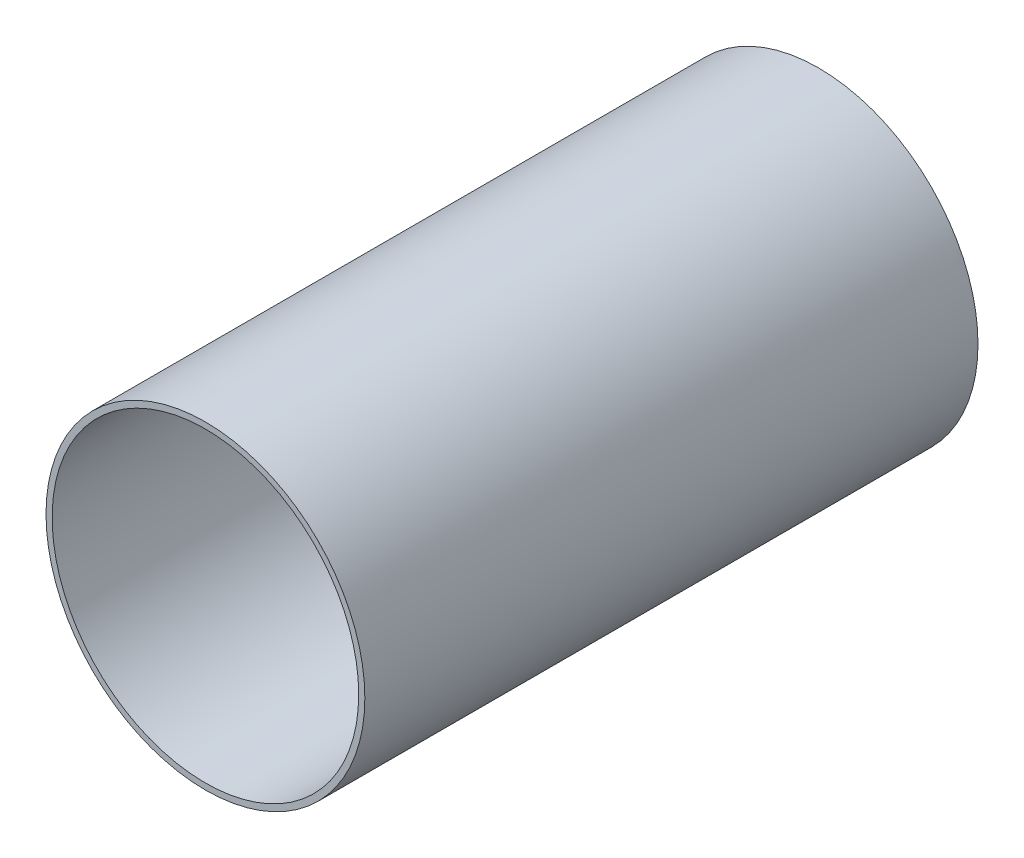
ISO-10303-21;
HEADER;
FILE_DESCRIPTION(('STEP AP214'),'2;1');
FILE_NAME('part.step','',(''),(''),'','','');
FILE_SCHEMA(('AUTOMOTIVE_DESIGN { 1 0 10303 214 1 1 1 1 }'));
ENDSEC;
DATA;
#1=APPLICATION_CONTEXT('core data for automotive mechanical design processes');
#2=APPLICATION_PROTOCOL_DEFINITION('international standard','automotive_design',2000,#1);
#3=PRODUCT_CONTEXT('',#1,'mechanical');
#4=PRODUCT('Part','Part','',(#3));
#5=PRODUCT_RELATED_PRODUCT_CATEGORY('part','',(#4));
#6=PRODUCT_DEFINITION_FORMATION('','',#4);
#7=PRODUCT_DEFINITION_CONTEXT('part definition',#1,'design');
#8=PRODUCT_DEFINITION('design','',#6,#7);
#9=PRODUCT_DEFINITION_SHAPE('','',#8);
#10=(LENGTH_UNIT() NAMED_UNIT(*) SI_UNIT(.MILLI.,.METRE.));
#11=(NAMED_UNIT(*) PLANE_ANGLE_UNIT() SI_UNIT($,.RADIAN.));
#12=(NAMED_UNIT(*) SI_UNIT($,.STERADIAN.) SOLID_ANGLE_UNIT());
#13=UNCERTAINTY_MEASURE_WITH_UNIT(LENGTH_MEASURE(1.E-05),#10,'distance_accuracy_value','');
#14=(GEOMETRIC_REPRESENTATION_CONTEXT(3) GLOBAL_UNCERTAINTY_ASSIGNED_CONTEXT((#13)) GLOBAL_UNIT_ASSIGNED_CONTEXT((#10,
#11,#12)) REPRESENTATION_CONTEXT('',''));
#15=CARTESIAN_POINT('',(0.,0.,0.));
#16=DIRECTION('',(0.,0.,1.));
#17=DIRECTION('',(1.,0.,0.));
#18=AXIS2_PLACEMENT_3D('',#15,#16,#17);
#19=CARTESIAN_POINT('',(0.,0.,100.));
#20=DIRECTION('',(0.,0.,1.));
#21=DIRECTION('',(1.,0.,0.));
#22=AXIS2_PLACEMENT_3D('',#19,#20,#21);
#23=PLANE('',#22);
#24=CARTESIAN_POINT('',(0.,0.,100.));
#25=DIRECTION('',(0.,0.,1.));
#26=DIRECTION('',(1.,0.,0.));
#27=AXIS2_PLACEMENT_3D('',#24,#25,#26);
#28=CIRCLE('',#27,52.);
#29=CARTESIAN_POINT('',(52.,0.,100.));
#30=VERTEX_POINT('',#29);
#31=EDGE_CURVE('E154',#30,#30,#28,.T.);
#32=ORIENTED_EDGE('',*,*,#31,.T.);
#33=EDGE_LOOP('',(#32));
#34=FACE_BOUND('',#33,.T.);
#35=CARTESIAN_POINT('',(0.,0.,100.));
#36=DIRECTION('',(0.,0.,1.));
#37=DIRECTION('',(1.,0.,0.));
#38=AXIS2_PLACEMENT_3D('',#35,#36,#37);
#39=CIRCLE('',#38,50.);
#40=CARTESIAN_POINT('',(50.,0.,100.));
#41=VERTEX_POINT('',#40);
#42=EDGE_CURVE('E108',#41,#41,#39,.T.);
#43=ORIENTED_EDGE('',*,*,#42,.F.);
#44=EDGE_LOOP('',(#43));
#45=FACE_BOUND('',#44,.T.);
#46=ADVANCED_FACE('F43',(#34,#45),#23,.T.);
#47=CARTESIAN_POINT('',(0.,0.,-100.));
#48=DIRECTION('',(0.,0.,1.));
#49=DIRECTION('',(1.,0.,0.));
#50=AXIS2_PLACEMENT_3D('',#47,#48,#49);
#51=PLANE('',#50);
#52=CARTESIAN_POINT('',(0.,0.,-100.));
#53=DIRECTION('',(0.,0.,1.));
#54=DIRECTION('',(1.,0.,0.));
#55=AXIS2_PLACEMENT_3D('',#52,#53,#54);
#56=CIRCLE('',#55,52.);
#57=CARTESIAN_POINT('',(52.,0.,-100.));
#58=VERTEX_POINT('',#57);
#59=EDGE_CURVE('E156',#58,#58,#56,.T.);
#60=ORIENTED_EDGE('',*,*,#59,.F.);
#61=EDGE_LOOP('',(#60));
#62=FACE_BOUND('',#61,.T.);
#63=CARTESIAN_POINT('',(0.,0.,-100.));
#64=DIRECTION('',(0.,0.,1.));
#65=DIRECTION('',(1.,0.,0.));
#66=AXIS2_PLACEMENT_3D('',#63,#64,#65);
#67=CIRCLE('',#66,50.);
#68=CARTESIAN_POINT('',(50.,0.,-100.));
#69=VERTEX_POINT('',#68);
#70=EDGE_CURVE('E105',#69,#69,#67,.T.);
#71=ORIENTED_EDGE('',*,*,#70,.T.);
#72=EDGE_LOOP('',(#71));
#73=FACE_BOUND('',#72,.T.);
#74=ADVANCED_FACE('F168',(#62,#73),#51,.F.);
#75=CARTESIAN_POINT('',(0.,0.,100.));
#76=DIRECTION('',(0.,0.,-1.));
#77=DIRECTION('',(-1.,0.,0.));
#78=AXIS2_PLACEMENT_3D('',#75,#76,#77);
#79=CYLINDRICAL_SURFACE('',#78,52.);
#80=CARTESIAN_POINT('',(-39.6356821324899,33.6602540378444,38.3012701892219));
#81=CARTESIAN_POINT('',(-39.5441065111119,33.7680893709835,38.4880316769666));
#82=CARTESIAN_POINT('',(-39.4562105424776,33.8706933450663,38.6797156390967));
#83=CARTESIAN_POINT('',(-39.2889634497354,34.0645520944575,39.0725721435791));
#84=CARTESIAN_POINT('',(-39.2096204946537,34.1557960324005,39.2737534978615));
#85=CARTESIAN_POINT('',(-39.0604007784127,34.3263459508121,39.6861152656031));
#86=CARTESIAN_POINT('',(-38.9905831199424,34.4055777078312,39.897348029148));
#87=CARTESIAN_POINT('',(-38.8623289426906,34.5503798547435,40.3277576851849));
#88=CARTESIAN_POINT('',(-38.8038892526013,34.6159540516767,40.5469323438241));
#89=CARTESIAN_POINT('',(-38.6993295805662,34.7328099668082,40.9934609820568));
#90=CARTESIAN_POINT('',(-38.6532867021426,34.7840023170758,41.2208566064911));
#91=CARTESIAN_POINT('',(-38.5751425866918,34.8706436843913,41.6810229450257));
#92=CARTESIAN_POINT('',(-38.5430422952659,34.9060916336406,41.9137940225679));
#93=CARTESIAN_POINT('',(-38.4937502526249,34.9604425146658,42.3820557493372));
#94=CARTESIAN_POINT('',(-38.4765101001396,34.9793991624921,42.6175350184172));
#95=CARTESIAN_POINT('',(-38.4572636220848,35.000558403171,43.0898541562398));
#96=CARTESIAN_POINT('',(-38.4552556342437,35.0027628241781,43.3266938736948));
#97=CARTESIAN_POINT('',(-38.4659928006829,34.9909622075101,43.7772945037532));
#98=CARTESIAN_POINT('',(-38.4773678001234,34.9784625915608,43.9911304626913));
#99=CARTESIAN_POINT('',(-38.5123814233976,34.9399077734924,44.416547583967));
#100=CARTESIAN_POINT('',(-38.5360192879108,34.9138534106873,44.628128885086));
#101=CARTESIAN_POINT('',(-38.5950449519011,34.8485930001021,45.0477991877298));
#102=CARTESIAN_POINT('',(-38.6304446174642,34.8093736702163,45.255884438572));
#103=CARTESIAN_POINT('',(-38.7122270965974,34.7183987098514,45.6670848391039));
#104=CARTESIAN_POINT('',(-38.7586103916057,34.6666425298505,45.870199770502));
#105=CARTESIAN_POINT('',(-38.861793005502,34.5509345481,46.2717208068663));
#106=CARTESIAN_POINT('',(-38.918657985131,34.4869057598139,46.470087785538));
#107=CARTESIAN_POINT('',(-39.0416011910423,34.3476639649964,46.8599323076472));
#108=CARTESIAN_POINT('',(-39.1076822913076,34.2724474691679,47.0514076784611));
#109=CARTESIAN_POINT('',(-39.3182362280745,34.0311874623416,47.6145331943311));
#110=CARTESIAN_POINT('',(-39.475066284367,33.8494817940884,47.9750584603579));
#111=CARTESIAN_POINT('',(-39.7701553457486,33.5018306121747,48.5744504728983));
#112=CARTESIAN_POINT('',(-39.9028726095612,33.3437811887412,48.8208161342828));
#113=CARTESIAN_POINT('',(-40.1793547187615,33.0100948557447,49.294792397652));
#114=CARTESIAN_POINT('',(-40.3231206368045,32.8344562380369,49.5224011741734));
#115=CARTESIAN_POINT('',(-40.6194448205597,32.4671601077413,49.9588246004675));
#116=CARTESIAN_POINT('',(-40.7720166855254,32.2754776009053,50.1676088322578));
#117=CARTESIAN_POINT('',(-41.0836221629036,31.8778885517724,50.5658277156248));
#118=CARTESIAN_POINT('',(-41.2426551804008,31.6719833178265,50.7552641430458));
#119=CARTESIAN_POINT('',(-41.5679515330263,31.2438607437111,51.1175411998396));
#120=CARTESIAN_POINT('',(-41.7342898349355,31.0214351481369,51.2900678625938));
#121=CARTESIAN_POINT('',(-42.0701019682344,30.5644716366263,51.6148270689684));
#122=CARTESIAN_POINT('',(-42.239575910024,30.3299332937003,51.7670588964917));
#123=CARTESIAN_POINT('',(-42.5801425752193,29.8499251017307,52.0508955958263));
#124=CARTESIAN_POINT('',(-42.7512348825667,29.6044580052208,52.1825056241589));
#125=CARTESIAN_POINT('',(-43.0937663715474,29.1035973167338,52.4247500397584));
#126=CARTESIAN_POINT('',(-43.2652055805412,28.8482029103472,52.5353827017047));
#127=CARTESIAN_POINT('',(-43.6361078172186,28.2846638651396,52.7520290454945));
#128=CARTESIAN_POINT('',(-43.8354148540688,27.9748937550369,52.854108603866));
#129=CARTESIAN_POINT('',(-44.2310559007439,27.3450549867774,53.0279064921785));
#130=CARTESIAN_POINT('',(-44.4273895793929,27.024985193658,53.0996214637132));
#131=CARTESIAN_POINT('',(-44.8154835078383,26.3764155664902,53.2115584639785));
#132=CARTESIAN_POINT('',(-45.0072414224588,26.0479115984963,53.2517647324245));
#133=CARTESIAN_POINT('',(-45.3844616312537,25.3849574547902,53.2993817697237));
#134=CARTESIAN_POINT('',(-45.5699243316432,25.0505076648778,53.3067946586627));
#135=CARTESIAN_POINT('',(-45.9292067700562,24.38540107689,53.2877904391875));
#136=CARTESIAN_POINT('',(-46.1031894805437,24.0548128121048,53.2620827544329));
#137=CARTESIAN_POINT('',(-46.4423008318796,23.3933928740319,53.1769982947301));
#138=CARTESIAN_POINT('',(-46.6074292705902,23.0625611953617,53.1176207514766));
#139=CARTESIAN_POINT('',(-46.9274703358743,22.4041580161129,52.9643797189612));
#140=CARTESIAN_POINT('',(-47.0823907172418,22.0765842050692,52.8705427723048));
#141=CARTESIAN_POINT('',(-47.3062674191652,21.5904838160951,52.703641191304));
#142=CARTESIAN_POINT('',(-47.3794748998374,21.4293288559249,52.6436504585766));
#143=CARTESIAN_POINT('',(-47.5229844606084,21.1091620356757,52.5149100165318));
#144=CARTESIAN_POINT('',(-47.5932855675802,20.9501509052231,52.4461574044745));
#145=CARTESIAN_POINT('',(-47.7832146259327,20.5147772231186,52.2442243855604));
#146=CARTESIAN_POINT('',(-47.8996558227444,20.2412220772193,52.101838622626));
#147=CARTESIAN_POINT('',(-48.1225068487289,19.7055459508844,51.7903670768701));
#148=CARTESIAN_POINT('',(-48.2289180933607,19.4434233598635,51.6212850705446));
#149=CARTESIAN_POINT('',(-48.4312298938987,18.933858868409,51.2573860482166));
#150=CARTESIAN_POINT('',(-48.5271434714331,18.6863989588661,51.0626015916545));
#151=CARTESIAN_POINT('',(-48.708311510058,18.2089434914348,50.6484777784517));
#152=CARTESIAN_POINT('',(-48.7935697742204,17.9789417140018,50.4291472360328));
#153=CARTESIAN_POINT('',(-48.971771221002,17.4885218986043,49.9142325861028));
#154=CARTESIAN_POINT('',(-49.0619764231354,17.233264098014,49.6127091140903));
#155=CARTESIAN_POINT('',(-49.1850795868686,16.8773152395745,49.1374747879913));
#156=CARTESIAN_POINT('',(-49.2240828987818,16.7631459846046,48.9752224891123));
#157=CARTESIAN_POINT('',(-49.2980880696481,16.5442379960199,48.6435137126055));
#158=CARTESIAN_POINT('',(-49.3330884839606,16.4395026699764,48.4740546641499));
#159=CARTESIAN_POINT('',(-49.3661088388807,16.3397459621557,48.3012701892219));
#160=B_SPLINE_CURVE_WITH_KNOTS('',3,(#80,#81,#82,#83,#84,#85,#86,#87,#88,#89,#90,#91,#92,#93,
#94,#95,#96,#97,#98,#99,#100,#101,#102,#103,#104,#105,#106,#107,#108,#109,#110,#111,#112,#113,
#114,#115,#116,#117,#118,#119,#120,#121,#122,#123,#124,#125,#126,#127,#128,#129,#130,#131,#132,
#133,#134,#135,#136,#137,#138,#139,#140,#141,#142,#143,#144,#145,#146,#147,#148,#149,#150,#151,
#152,#153,#154,#155,#156,#157,#158,#159),.UNSPECIFIED.,.F.,.F.,(4,2,2,2,2,2,2,2,2,2,2,2,2,2,2,2,
2,2,2,2,2,2,2,2,2,2,2,2,2,2,2,2,2,2,2,2,2,2,2,4),(0.,0.702864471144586,1.40639441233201,
2.11410832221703,2.82162469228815,3.53344490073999,4.24531337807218,4.95485435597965,
5.66431790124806,6.3070374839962,6.94971727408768,7.59304742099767,8.23640577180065,
8.88394046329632,9.53167753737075,10.8265899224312,11.7896291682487,12.7527620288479,
13.7174242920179,14.6819979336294,15.6620021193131,16.6420408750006,17.6218341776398,
18.6017080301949,19.7470344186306,20.8924874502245,22.0385130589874,23.184464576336,
24.3062737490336,25.4281085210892,26.5490809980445,27.1095546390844,27.6702144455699,
28.6576494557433,29.6449449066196,30.6310014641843,31.6167050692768,32.8289750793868,
33.4352217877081,34.0416866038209),.UNSPECIFIED.);
#161=CARTESIAN_POINT('',(-39.6356821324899,33.6602540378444,38.3012701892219));
#162=VERTEX_POINT('',#161);
#163=CARTESIAN_POINT('',(-49.3661088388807,16.3397459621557,48.3012701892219));
#164=VERTEX_POINT('',#163);
#165=EDGE_CURVE('E98',#162,#164,#160,.T.);
#166=ORIENTED_EDGE('',*,*,#165,.T.);
#167=CARTESIAN_POINT('',(0.,0.,19.9999999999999));
#168=DIRECTION('',(0.,-0.866025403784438,0.500000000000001));
#169=DIRECTION('',(0.,-0.500000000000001,-0.866025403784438));
#170=AXIS2_PLACEMENT_3D('',#167,#168,#169);
#171=ELLIPSE('',#170,104.,52.);
#172=CARTESIAN_POINT('',(-39.6356821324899,-33.6602540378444,-38.3012701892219));
#173=VERTEX_POINT('',#172);
#174=EDGE_CURVE('E64',#164,#173,#171,.T.);
#175=ORIENTED_EDGE('',*,*,#174,.T.);
#176=CARTESIAN_POINT('',(-39.6356821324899,-33.6602540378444,-38.3012701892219));
#177=CARTESIAN_POINT('',(-39.5441065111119,-33.7680893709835,-38.4880316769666));
#178=CARTESIAN_POINT('',(-39.4562105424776,-33.8706933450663,-38.6797156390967));
#179=CARTESIAN_POINT('',(-39.2889634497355,-34.0645520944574,-39.0725721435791));
#180=CARTESIAN_POINT('',(-39.2096204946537,-34.1557960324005,-39.2737534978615));
#181=CARTESIAN_POINT('',(-39.0604007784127,-34.3263459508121,-39.6861152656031));
#182=CARTESIAN_POINT('',(-38.9905831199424,-34.4055777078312,-39.897348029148));
#183=CARTESIAN_POINT('',(-38.8623289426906,-34.5503798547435,-40.3277576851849));
#184=CARTESIAN_POINT('',(-38.8038892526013,-34.6159540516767,-40.5469323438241));
#185=CARTESIAN_POINT('',(-38.6993295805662,-34.7328099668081,-40.9934609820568));
#186=CARTESIAN_POINT('',(-38.6532867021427,-34.7840023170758,-41.2208566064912));
#187=CARTESIAN_POINT('',(-38.5751425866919,-34.8706436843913,-41.6810229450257));
#188=CARTESIAN_POINT('',(-38.5430422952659,-34.9060916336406,-41.9137940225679));
#189=CARTESIAN_POINT('',(-38.4937502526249,-34.9604425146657,-42.3820557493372));
#190=CARTESIAN_POINT('',(-38.4765101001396,-34.9793991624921,-42.6175350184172));
#191=CARTESIAN_POINT('',(-38.4572636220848,-35.000558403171,-43.0898541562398));
#192=CARTESIAN_POINT('',(-38.4552556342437,-35.0027628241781,-43.3266938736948));
#193=CARTESIAN_POINT('',(-38.465992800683,-34.9909622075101,-43.7772945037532));
#194=CARTESIAN_POINT('',(-38.4773678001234,-34.9784625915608,-43.9911304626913));
#195=CARTESIAN_POINT('',(-38.5123814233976,-34.9399077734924,-44.416547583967));
#196=CARTESIAN_POINT('',(-38.5360192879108,-34.9138534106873,-44.628128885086));
#197=CARTESIAN_POINT('',(-38.5950449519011,-34.8485930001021,-45.0477991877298));
#198=CARTESIAN_POINT('',(-38.6304446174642,-34.8093736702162,-45.255884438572));
#199=CARTESIAN_POINT('',(-38.7122270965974,-34.7183987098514,-45.6670848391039));
#200=CARTESIAN_POINT('',(-38.7586103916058,-34.6666425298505,-45.8701997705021));
#201=CARTESIAN_POINT('',(-38.861793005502,-34.5509345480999,-46.2717208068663));
#202=CARTESIAN_POINT('',(-38.918657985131,-34.4869057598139,-46.4700877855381));
#203=CARTESIAN_POINT('',(-39.0416011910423,-34.3476639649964,-46.8599323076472));
#204=CARTESIAN_POINT('',(-39.1076822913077,-34.2724474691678,-47.0514076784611));
#205=CARTESIAN_POINT('',(-39.3182362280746,-34.0311874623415,-47.6145331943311));
#206=CARTESIAN_POINT('',(-39.475066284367,-33.8494817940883,-47.9750584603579));
#207=CARTESIAN_POINT('',(-39.7701553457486,-33.5018306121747,-48.5744504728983));
#208=CARTESIAN_POINT('',(-39.9028726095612,-33.3437811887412,-48.8208161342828));
#209=CARTESIAN_POINT('',(-40.1793547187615,-33.0100948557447,-49.294792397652));
#210=CARTESIAN_POINT('',(-40.3231206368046,-32.8344562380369,-49.5224011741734));
#211=CARTESIAN_POINT('',(-40.6194448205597,-32.4671601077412,-49.9588246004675));
#212=CARTESIAN_POINT('',(-40.7720166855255,-32.2754776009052,-50.1676088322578));
#213=CARTESIAN_POINT('',(-41.0836221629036,-31.8778885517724,-50.5658277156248));
#214=CARTESIAN_POINT('',(-41.2426551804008,-31.6719833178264,-50.7552641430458));
#215=CARTESIAN_POINT('',(-41.5679515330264,-31.2438607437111,-51.1175411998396));
#216=CARTESIAN_POINT('',(-41.7342898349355,-31.0214351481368,-51.2900678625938));
#217=CARTESIAN_POINT('',(-42.0701019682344,-30.5644716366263,-51.6148270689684));
#218=CARTESIAN_POINT('',(-42.2395759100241,-30.3299332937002,-51.7670588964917));
#219=CARTESIAN_POINT('',(-42.5801425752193,-29.8499251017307,-52.0508955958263));
#220=CARTESIAN_POINT('',(-42.7512348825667,-29.6044580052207,-52.1825056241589));
#221=CARTESIAN_POINT('',(-43.0937663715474,-29.1035973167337,-52.4247500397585));
#222=CARTESIAN_POINT('',(-43.2652055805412,-28.8482029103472,-52.5353827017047));
#223=CARTESIAN_POINT('',(-43.6361078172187,-28.2846638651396,-52.7520290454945));
#224=CARTESIAN_POINT('',(-43.8354148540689,-27.9748937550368,-52.854108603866));
#225=CARTESIAN_POINT('',(-44.231055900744,-27.3450549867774,-53.0279064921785));
#226=CARTESIAN_POINT('',(-44.427389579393,-27.0249851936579,-53.0996214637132));
#227=CARTESIAN_POINT('',(-44.8154835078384,-26.3764155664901,-53.2115584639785));
#228=CARTESIAN_POINT('',(-45.0072414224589,-26.0479115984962,-53.2517647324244));
#229=CARTESIAN_POINT('',(-45.3844616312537,-25.3849574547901,-53.2993817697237));
#230=CARTESIAN_POINT('',(-45.5699243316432,-25.0505076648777,-53.3067946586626));
#231=CARTESIAN_POINT('',(-45.9292067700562,-24.38540107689,-53.2877904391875));
#232=CARTESIAN_POINT('',(-46.1031894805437,-24.0548128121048,-53.2620827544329));
#233=CARTESIAN_POINT('',(-46.4423008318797,-23.3933928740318,-53.1769982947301));
#234=CARTESIAN_POINT('',(-46.6074292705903,-23.0625611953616,-53.1176207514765));
#235=CARTESIAN_POINT('',(-46.9274703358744,-22.4041580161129,-52.9643797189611));
#236=CARTESIAN_POINT('',(-47.0823907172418,-22.0765842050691,-52.8705427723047));
#237=CARTESIAN_POINT('',(-47.3062674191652,-21.5904838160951,-52.7036411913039));
#238=CARTESIAN_POINT('',(-47.3794748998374,-21.4293288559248,-52.6436504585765));
#239=CARTESIAN_POINT('',(-47.5229844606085,-21.1091620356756,-52.5149100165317));
#240=CARTESIAN_POINT('',(-47.5932855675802,-20.9501509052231,-52.4461574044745));
#241=CARTESIAN_POINT('',(-47.7832146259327,-20.5147772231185,-52.2442243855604));
#242=CARTESIAN_POINT('',(-47.8996558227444,-20.2412220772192,-52.101838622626));
#243=CARTESIAN_POINT('',(-48.1225068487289,-19.7055459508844,-51.79036707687));
#244=CARTESIAN_POINT('',(-48.2289180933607,-19.4434233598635,-51.6212850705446));
#245=CARTESIAN_POINT('',(-48.4312298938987,-18.933858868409,-51.2573860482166));
#246=CARTESIAN_POINT('',(-48.5271434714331,-18.6863989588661,-51.0626015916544));
#247=CARTESIAN_POINT('',(-48.708311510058,-18.2089434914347,-50.6484777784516));
#248=CARTESIAN_POINT('',(-48.7935697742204,-17.9789417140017,-50.4291472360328));
#249=CARTESIAN_POINT('',(-48.971771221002,-17.4885218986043,-49.9142325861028));
#250=CARTESIAN_POINT('',(-49.0619764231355,-17.2332640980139,-49.6127091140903));
#251=CARTESIAN_POINT('',(-49.1850795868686,-16.8773152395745,-49.1374747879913));
#252=CARTESIAN_POINT('',(-49.2240828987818,-16.7631459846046,-48.9752224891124));
#253=CARTESIAN_POINT('',(-49.2980880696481,-16.5442379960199,-48.6435137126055));
#254=CARTESIAN_POINT('',(-49.3330884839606,-16.4395026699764,-48.4740546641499));
#255=CARTESIAN_POINT('',(-49.3661088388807,-16.3397459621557,-48.301270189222));
#256=B_SPLINE_CURVE_WITH_KNOTS('',3,(#176,#177,#178,#179,#180,#181,#182,#183,#184,#185,#186,
#187,#188,#189,#190,#191,#192,#193,#194,#195,#196,#197,#198,#199,#200,#201,#202,#203,#204,#205,
#206,#207,#208,#209,#210,#211,#212,#213,#214,#215,#216,#217,#218,#219,#220,#221,#222,#223,#224,
#225,#226,#227,#228,#229,#230,#231,#232,#233,#234,#235,#236,#237,#238,#239,#240,#241,#242,#243,
#244,#245,#246,#247,#248,#249,#250,#251,#252,#253,#254,#255),.UNSPECIFIED.,.F.,.F.,(4,2,2,2,2,2,
2,2,2,2,2,2,2,2,2,2,2,2,2,2,2,2,2,2,2,2,2,2,2,2,2,2,2,2,2,2,2,2,2,4),(0.,0.702864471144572,
1.40639441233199,2.11410832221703,2.82162469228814,3.53344490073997,4.24531337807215,
4.95485435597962,5.66431790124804,6.30703748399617,6.94971727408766,7.59304742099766,
8.23640577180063,8.88394046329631,9.53167753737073,10.8265899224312,11.7896291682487,
12.7527620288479,13.7174242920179,14.6819979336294,15.6620021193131,16.6420408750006,
17.6218341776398,18.6017080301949,19.7470344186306,20.8924874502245,22.0385130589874,
23.1844645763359,24.3062737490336,25.4281085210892,26.5490809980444,27.1095546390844,
27.6702144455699,28.6576494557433,29.6449449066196,30.6310014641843,31.6167050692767,
32.8289750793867,33.4352217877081,34.0416866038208),.UNSPECIFIED.);
#257=CARTESIAN_POINT('',(-49.3661088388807,-16.3397459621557,-48.301270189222));
#258=VERTEX_POINT('',#257);
#259=EDGE_CURVE('E91',#173,#258,#256,.T.);
#260=ORIENTED_EDGE('',*,*,#259,.T.);
#261=CARTESIAN_POINT('',(0.,0.,-20.));
#262=DIRECTION('',(0.,0.866025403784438,-0.500000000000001));
#263=DIRECTION('',(0.,-0.500000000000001,-0.866025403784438));
#264=AXIS2_PLACEMENT_3D('',#261,#262,#263);
#265=ELLIPSE('',#264,104.,52.);
#266=EDGE_CURVE('E104',#258,#162,#265,.T.);
#267=ORIENTED_EDGE('',*,*,#266,.T.);
#268=EDGE_LOOP('',(#166,#175,#260,#267));
#269=FACE_BOUND('',#268,.T.);
#270=ORIENTED_EDGE('',*,*,#31,.F.);
#271=EDGE_LOOP('',(#270));
#272=FACE_BOUND('',#271,.T.);
#273=ORIENTED_EDGE('',*,*,#59,.T.);
#274=EDGE_LOOP('',(#273));
#275=FACE_BOUND('',#274,.T.);
#276=ADVANCED_FACE('F45',(#269,#272,#275),#79,.T.);
#277=CARTESIAN_POINT('',(0.,0.,100.));
#278=DIRECTION('',(0.,0.,-1.));
#279=DIRECTION('',(-1.,0.,0.));
#280=AXIS2_PLACEMENT_3D('',#277,#278,#279);
#281=CYLINDRICAL_SURFACE('',#280,50.);
#282=CARTESIAN_POINT('',(-36.9727913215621,33.6602540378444,38.3012701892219));
#283=CARTESIAN_POINT('',(-36.8773773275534,33.7650620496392,38.4827951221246));
#284=CARTESIAN_POINT('',(-36.7855579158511,33.8650176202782,38.669113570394));
#285=CARTESIAN_POINT('',(-36.6103313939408,34.0543716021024,39.0511134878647));
#286=CARTESIAN_POINT('',(-36.526933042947,34.1437590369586,39.2468044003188));
#287=CARTESIAN_POINT('',(-36.3694135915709,34.3115011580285,39.6483775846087));
#288=CARTESIAN_POINT('',(-36.295362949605,34.3897725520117,39.8543226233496));
#289=CARTESIAN_POINT('',(-36.1586896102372,34.5334475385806,40.2742899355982));
#290=CARTESIAN_POINT('',(-36.0960635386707,34.5988549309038,40.4883098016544));
#291=CARTESIAN_POINT('',(-35.9832396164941,34.7161799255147,40.9248731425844));
#292=CARTESIAN_POINT('',(-35.9331272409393,34.768004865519,41.1474638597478));
#293=CARTESIAN_POINT('',(-35.8471760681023,34.8566176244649,41.5983690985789));
#294=CARTESIAN_POINT('',(-35.8113382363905,34.8934044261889,41.826684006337));
#295=CARTESIAN_POINT('',(-35.7550824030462,34.9510472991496,42.2863310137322));
#296=CARTESIAN_POINT('',(-35.7346072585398,34.9719624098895,42.5176486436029));
#297=CARTESIAN_POINT('',(-35.7094927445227,34.9976065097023,42.9820240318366));
#298=CARTESIAN_POINT('',(-35.7048513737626,35.0023375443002,43.215081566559));
#299=CARTESIAN_POINT('',(-35.7111930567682,34.995866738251,43.6565383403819));
#300=CARTESIAN_POINT('',(-35.7206049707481,34.9862670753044,43.8649871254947));
#301=CARTESIAN_POINT('',(-35.7520120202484,34.9541720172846,44.2799179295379));
#302=CARTESIAN_POINT('',(-35.7740063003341,34.9316774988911,44.4864000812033));
#303=CARTESIAN_POINT('',(-35.8300742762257,34.8741649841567,44.8961769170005));
#304=CARTESIAN_POINT('',(-35.8641615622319,34.8391328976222,45.0994677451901));
#305=CARTESIAN_POINT('',(-35.9436357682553,34.7571331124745,45.5013670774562));
#306=CARTESIAN_POINT('',(-35.989023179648,34.7101648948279,45.699975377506));
#307=CARTESIAN_POINT('',(-36.0900022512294,34.6051587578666,46.0908472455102));
#308=CARTESIAN_POINT('',(-36.1455604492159,34.5471571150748,46.2831292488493));
#309=CARTESIAN_POINT('',(-36.2659708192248,34.420734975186,46.6612617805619));
#310=CARTESIAN_POINT('',(-36.3308258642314,34.3523112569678,46.8471102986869));
#311=CARTESIAN_POINT('',(-36.5378002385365,34.1325287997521,47.3940884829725));
#312=CARTESIAN_POINT('',(-36.6923778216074,33.9666083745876,47.744834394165));
#313=CARTESIAN_POINT('',(-36.9877298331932,33.6443744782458,48.337212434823));
#314=CARTESIAN_POINT('',(-37.1233488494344,33.4948066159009,48.5852453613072));
#315=CARTESIAN_POINT('',(-37.4064325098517,33.1783640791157,49.062899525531));
#316=CARTESIAN_POINT('',(-37.5538988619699,33.0114869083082,49.2925180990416));
#317=CARTESIAN_POINT('',(-37.8582667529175,32.6619877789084,49.7334755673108));
#318=CARTESIAN_POINT('',(-38.0151843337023,32.4793388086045,49.9447818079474));
#319=CARTESIAN_POINT('',(-38.3359726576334,32.1000760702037,50.3486556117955));
#320=CARTESIAN_POINT('',(-38.499842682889,31.9034637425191,50.5412251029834));
#321=CARTESIAN_POINT('',(-38.8360862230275,31.4933353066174,50.9114266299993));
#322=CARTESIAN_POINT('',(-39.0085654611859,31.2795539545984,51.0886680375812));
#323=CARTESIAN_POINT('',(-39.3570725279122,30.8399017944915,51.4235798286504));
#324=CARTESIAN_POINT('',(-39.5331005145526,30.6140304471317,51.581249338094));
#325=CARTESIAN_POINT('',(-39.8871365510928,30.1513046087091,51.8767815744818));
#326=CARTESIAN_POINT('',(-40.0651439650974,29.9144535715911,52.0146504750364));
#327=CARTESIAN_POINT('',(-40.4218623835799,29.4306541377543,52.2703377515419));
#328=CARTESIAN_POINT('',(-40.6005734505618,29.1837048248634,52.3881543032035));
#329=CARTESIAN_POINT('',(-40.9934154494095,28.6300028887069,52.624953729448));
#330=CARTESIAN_POINT('',(-41.2074359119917,28.321217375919,52.7393987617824));
#331=CARTESIAN_POINT('',(-41.632796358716,27.6921374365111,52.9377206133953));
#332=CARTESIAN_POINT('',(-41.8441360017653,27.3718415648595,53.0215935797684));
#333=CARTESIAN_POINT('',(-42.2624417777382,26.7214442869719,53.1575913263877));
#334=CARTESIAN_POINT('',(-42.4694048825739,26.3913364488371,53.2096947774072));
#335=CARTESIAN_POINT('',(-42.8770548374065,25.7237459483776,53.2806918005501));
#336=CARTESIAN_POINT('',(-43.0777420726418,25.3862637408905,53.2995874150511));
#337=CARTESIAN_POINT('',(-43.4687004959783,24.7107751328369,53.3027180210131));
#338=CARTESIAN_POINT('',(-43.6590710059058,24.3728288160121,53.2873863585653));
#339=CARTESIAN_POINT('',(-44.0305195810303,23.6952032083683,53.2216228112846));
#340=CARTESIAN_POINT('',(-44.2115973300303,23.3555238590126,53.1711897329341));
#341=CARTESIAN_POINT('',(-44.5628621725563,22.6781088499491,53.0341037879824));
#342=CARTESIAN_POINT('',(-44.7330590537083,22.3403716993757,52.947484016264));
#343=CARTESIAN_POINT('',(-44.9792034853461,21.8381804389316,52.7898796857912));
#344=CARTESIAN_POINT('',(-45.059724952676,21.6715224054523,52.7327338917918));
#345=CARTESIAN_POINT('',(-45.2176284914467,21.3400975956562,52.6091379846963));
#346=CARTESIAN_POINT('',(-45.2950094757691,21.1753314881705,52.5426846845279));
#347=CARTESIAN_POINT('',(-45.502681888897,20.7269003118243,52.34765550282));
#348=CARTESIAN_POINT('',(-45.6296217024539,20.4457426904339,52.2095761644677));
#349=CARTESIAN_POINT('',(-45.8727577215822,19.8942444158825,51.9053641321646));
#350=CARTESIAN_POINT('',(-45.9889556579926,19.6239020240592,51.7392359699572));
#351=CARTESIAN_POINT('',(-46.2100054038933,19.09755945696,51.379798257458));
#352=CARTESIAN_POINT('',(-46.314872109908,18.8415406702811,51.1865251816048));
#353=CARTESIAN_POINT('',(-46.5130740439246,18.3467963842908,50.7737914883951));
#354=CARTESIAN_POINT('',(-46.606413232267,18.1080649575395,50.5543399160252));
#355=CARTESIAN_POINT('',(-46.7503583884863,17.7321451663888,50.1731288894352));
#356=CARTESIAN_POINT('',(-46.804382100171,17.5889647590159,50.018501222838));
#357=CARTESIAN_POINT('',(-46.907553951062,17.3119384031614,49.6995747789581));
#358=CARTESIAN_POINT('',(-46.9567027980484,17.1780911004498,49.5352774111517));
#359=CARTESIAN_POINT('',(-47.0501518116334,16.9204614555,49.1975543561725));
#360=CARTESIAN_POINT('',(-47.0944500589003,16.7966831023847,49.0241250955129));
#361=CARTESIAN_POINT('',(-47.1782233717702,16.5599211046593,48.6688335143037));
#362=CARTESIAN_POINT('',(-47.2176965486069,16.4469416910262,48.4869679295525));
#363=CARTESIAN_POINT('',(-47.2547638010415,16.3397459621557,48.3012701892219));
#364=B_SPLINE_CURVE_WITH_KNOTS('',3,(#282,#283,#284,#285,#286,#287,#288,#289,#290,#291,#292,
#293,#294,#295,#296,#297,#298,#299,#300,#301,#302,#303,#304,#305,#306,#307,#308,#309,#310,#311,
#312,#313,#314,#315,#316,#317,#318,#319,#320,#321,#322,#323,#324,#325,#326,#327,#328,#329,#330,
#331,#332,#333,#334,#335,#336,#337,#338,#339,#340,#341,#342,#343,#344,#345,#346,#347,#348,#349,
#350,#351,#352,#353,#354,#355,#356,#357,#358,#359,#360,#361,#362,#363),.UNSPECIFIED.,.F.,.F.,(4,
2,2,2,2,2,2,2,2,2,2,2,2,2,2,2,2,2,2,2,2,2,2,2,2,2,2,2,2,2,2,2,2,2,2,2,2,2,2,2,4),(0.,
0.6909033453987,1.3825180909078,2.07906880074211,2.77541345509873,3.4763918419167,
4.17741763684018,4.87582279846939,5.57413968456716,6.20000306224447,6.82582389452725,
7.452350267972,8.07890389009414,8.70343201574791,9.32815355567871,10.5770121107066,
11.5353227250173,12.4937717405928,13.4538961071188,14.4139215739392,15.3937738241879,
16.3736698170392,17.3532596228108,18.3329385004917,19.5097949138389,20.686799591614,
21.8645936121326,23.0423151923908,24.2052104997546,25.3681453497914,26.5300189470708,
27.1109323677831,27.6920451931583,28.7044186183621,29.7166286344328,30.7274913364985,
31.7380057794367,32.3902401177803,33.0423796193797,33.6947762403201,34.3474274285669),.UNSPECIFIED.);
#365=CARTESIAN_POINT('',(-36.9727913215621,33.6602540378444,38.3012701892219));
#366=VERTEX_POINT('',#365);
#367=CARTESIAN_POINT('',(-47.2547638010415,16.3397459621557,48.3012701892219));
#368=VERTEX_POINT('',#367);
#369=EDGE_CURVE('E12',#366,#368,#364,.T.);
#370=ORIENTED_EDGE('',*,*,#369,.F.);
#371=CARTESIAN_POINT('',(0.,0.,-20.));
#372=DIRECTION('',(0.,0.866025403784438,-0.500000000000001));
#373=DIRECTION('',(0.,-0.500000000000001,-0.866025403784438));
#374=AXIS2_PLACEMENT_3D('',#371,#372,#373);
#375=ELLIPSE('',#374,99.9999999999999,50.);
#376=CARTESIAN_POINT('',(-47.2547638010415,-16.3397459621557,-48.301270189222));
#377=VERTEX_POINT('',#376);
#378=EDGE_CURVE('E57',#377,#366,#375,.T.);
#379=ORIENTED_EDGE('',*,*,#378,.F.);
#380=CARTESIAN_POINT('',(-36.9727913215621,-33.6602540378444,-38.3012701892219));
#381=CARTESIAN_POINT('',(-36.8773773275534,-33.7650620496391,-38.4827951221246));
#382=CARTESIAN_POINT('',(-36.7855579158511,-33.8650176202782,-38.669113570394));
#383=CARTESIAN_POINT('',(-36.6103313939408,-34.0543716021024,-39.0511134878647));
#384=CARTESIAN_POINT('',(-36.526933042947,-34.1437590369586,-39.2468044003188));
#385=CARTESIAN_POINT('',(-36.3694135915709,-34.3115011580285,-39.6483775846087));
#386=CARTESIAN_POINT('',(-36.295362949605,-34.3897725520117,-39.8543226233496));
#387=CARTESIAN_POINT('',(-36.1586896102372,-34.5334475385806,-40.2742899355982));
#388=CARTESIAN_POINT('',(-36.0960635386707,-34.5988549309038,-40.4883098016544));
#389=CARTESIAN_POINT('',(-35.9832396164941,-34.7161799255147,-40.9248731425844));
#390=CARTESIAN_POINT('',(-35.9331272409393,-34.768004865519,-41.1474638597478));
#391=CARTESIAN_POINT('',(-35.8471760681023,-34.8566176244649,-41.5983690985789));
#392=CARTESIAN_POINT('',(-35.8113382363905,-34.8934044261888,-41.826684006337));
#393=CARTESIAN_POINT('',(-35.7550824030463,-34.9510472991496,-42.2863310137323));
#394=CARTESIAN_POINT('',(-35.7346072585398,-34.9719624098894,-42.5176486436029));
#395=CARTESIAN_POINT('',(-35.7094927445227,-34.9976065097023,-42.9820240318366));
#396=CARTESIAN_POINT('',(-35.7048513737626,-35.0023375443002,-43.215081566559));
#397=CARTESIAN_POINT('',(-35.7111930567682,-34.995866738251,-43.6565383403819));
#398=CARTESIAN_POINT('',(-35.7206049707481,-34.9862670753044,-43.8649871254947));
#399=CARTESIAN_POINT('',(-35.7520120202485,-34.9541720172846,-44.2799179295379));
#400=CARTESIAN_POINT('',(-35.7740063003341,-34.9316774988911,-44.4864000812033));
#401=CARTESIAN_POINT('',(-35.8300742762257,-34.8741649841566,-44.8961769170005));
#402=CARTESIAN_POINT('',(-35.8641615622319,-34.8391328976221,-45.0994677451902));
#403=CARTESIAN_POINT('',(-35.9436357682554,-34.7571331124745,-45.5013670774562));
#404=CARTESIAN_POINT('',(-35.9890231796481,-34.7101648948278,-45.699975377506));
#405=CARTESIAN_POINT('',(-36.0900022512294,-34.6051587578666,-46.0908472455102));
#406=CARTESIAN_POINT('',(-36.1455604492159,-34.5471571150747,-46.2831292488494));
#407=CARTESIAN_POINT('',(-36.2659708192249,-34.420734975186,-46.661261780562));
#408=CARTESIAN_POINT('',(-36.3308258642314,-34.3523112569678,-46.8471102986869));
#409=CARTESIAN_POINT('',(-36.5378002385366,-34.132528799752,-47.3940884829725));
#410=CARTESIAN_POINT('',(-36.6923778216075,-33.9666083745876,-47.744834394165));
#411=CARTESIAN_POINT('',(-36.9877298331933,-33.6443744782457,-48.337212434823));
#412=CARTESIAN_POINT('',(-37.1233488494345,-33.4948066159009,-48.5852453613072));
#413=CARTESIAN_POINT('',(-37.4064325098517,-33.1783640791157,-49.062899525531));
#414=CARTESIAN_POINT('',(-37.55389886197,-33.0114869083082,-49.2925180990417));
#415=CARTESIAN_POINT('',(-37.8582667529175,-32.6619877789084,-49.7334755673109));
#416=CARTESIAN_POINT('',(-38.0151843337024,-32.4793388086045,-49.9447818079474));
#417=CARTESIAN_POINT('',(-38.3359726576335,-32.1000760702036,-50.3486556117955));
#418=CARTESIAN_POINT('',(-38.4998426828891,-31.9034637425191,-50.5412251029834));
#419=CARTESIAN_POINT('',(-38.8360862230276,-31.4933353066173,-50.9114266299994));
#420=CARTESIAN_POINT('',(-39.008565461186,-31.2795539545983,-51.0886680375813));
#421=CARTESIAN_POINT('',(-39.3570725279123,-30.8399017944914,-51.4235798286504));
#422=CARTESIAN_POINT('',(-39.5331005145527,-30.6140304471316,-51.581249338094));
#423=CARTESIAN_POINT('',(-39.8871365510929,-30.151304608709,-51.8767815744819));
#424=CARTESIAN_POINT('',(-40.0651439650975,-29.9144535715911,-52.0146504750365));
#425=CARTESIAN_POINT('',(-40.4218623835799,-29.4306541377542,-52.2703377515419));
#426=CARTESIAN_POINT('',(-40.6005734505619,-29.1837048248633,-52.3881543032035));
#427=CARTESIAN_POINT('',(-40.9934154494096,-28.6300028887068,-52.624953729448));
#428=CARTESIAN_POINT('',(-41.2074359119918,-28.3212173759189,-52.7393987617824));
#429=CARTESIAN_POINT('',(-41.6327963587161,-27.692137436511,-52.9377206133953));
#430=CARTESIAN_POINT('',(-41.8441360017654,-27.3718415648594,-53.0215935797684));
#431=CARTESIAN_POINT('',(-42.2624417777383,-26.7214442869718,-53.1575913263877));
#432=CARTESIAN_POINT('',(-42.4694048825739,-26.391336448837,-53.2096947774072));
#433=CARTESIAN_POINT('',(-42.8770548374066,-25.7237459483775,-53.2806918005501));
#434=CARTESIAN_POINT('',(-43.0777420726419,-25.3862637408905,-53.2995874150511));
#435=CARTESIAN_POINT('',(-43.4687004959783,-24.7107751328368,-53.3027180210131));
#436=CARTESIAN_POINT('',(-43.6590710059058,-24.372828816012,-53.2873863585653));
#437=CARTESIAN_POINT('',(-44.0305195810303,-23.6952032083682,-53.2216228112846));
#438=CARTESIAN_POINT('',(-44.2115973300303,-23.3555238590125,-53.1711897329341));
#439=CARTESIAN_POINT('',(-44.5628621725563,-22.678108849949,-53.0341037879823));
#440=CARTESIAN_POINT('',(-44.7330590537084,-22.3403716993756,-52.9474840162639));
#441=CARTESIAN_POINT('',(-44.9792034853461,-21.8381804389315,-52.7898796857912));
#442=CARTESIAN_POINT('',(-45.059724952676,-21.6715224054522,-52.7327338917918));
#443=CARTESIAN_POINT('',(-45.2176284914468,-21.3400975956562,-52.6091379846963));
#444=CARTESIAN_POINT('',(-45.2950094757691,-21.1753314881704,-52.5426846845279));
#445=CARTESIAN_POINT('',(-45.502681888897,-20.7269003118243,-52.34765550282));
#446=CARTESIAN_POINT('',(-45.6296217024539,-20.4457426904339,-52.2095761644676));
#447=CARTESIAN_POINT('',(-45.8727577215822,-19.8942444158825,-51.9053641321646));
#448=CARTESIAN_POINT('',(-45.9889556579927,-19.6239020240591,-51.7392359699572));
#449=CARTESIAN_POINT('',(-46.2100054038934,-19.0975594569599,-51.3797982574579));
#450=CARTESIAN_POINT('',(-46.314872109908,-18.841540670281,-51.1865251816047));
#451=CARTESIAN_POINT('',(-46.5130740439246,-18.3467963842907,-50.7737914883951));
#452=CARTESIAN_POINT('',(-46.606413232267,-18.1080649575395,-50.5543399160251));
#453=CARTESIAN_POINT('',(-46.7503583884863,-17.7321451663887,-50.1731288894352));
#454=CARTESIAN_POINT('',(-46.804382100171,-17.5889647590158,-50.018501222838));
#455=CARTESIAN_POINT('',(-46.907553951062,-17.3119384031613,-49.699574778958));
#456=CARTESIAN_POINT('',(-46.9567027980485,-17.1780911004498,-49.5352774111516));
#457=CARTESIAN_POINT('',(-47.0501518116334,-16.9204614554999,-49.1975543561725));
#458=CARTESIAN_POINT('',(-47.0944500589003,-16.7966831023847,-49.0241250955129));
#459=CARTESIAN_POINT('',(-47.1782233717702,-16.5599211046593,-48.6688335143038));
#460=CARTESIAN_POINT('',(-47.2176965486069,-16.4469416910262,-48.4869679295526));
#461=CARTESIAN_POINT('',(-47.2547638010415,-16.3397459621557,-48.301270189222));
#462=B_SPLINE_CURVE_WITH_KNOTS('',3,(#380,#381,#382,#383,#384,#385,#386,#387,#388,#389,#390,
#391,#392,#393,#394,#395,#396,#397,#398,#399,#400,#401,#402,#403,#404,#405,#406,#407,#408,#409,
#410,#411,#412,#413,#414,#415,#416,#417,#418,#419,#420,#421,#422,#423,#424,#425,#426,#427,#428,
#429,#430,#431,#432,#433,#434,#435,#436,#437,#438,#439,#440,#441,#442,#443,#444,#445,#446,#447,
#448,#449,#450,#451,#452,#453,#454,#455,#456,#457,#458,#459,#460,#461),.UNSPECIFIED.,.F.,.F.,(4,
2,2,2,2,2,2,2,2,2,2,2,2,2,2,2,2,2,2,2,2,2,2,2,2,2,2,2,2,2,2,2,2,2,2,2,2,2,2,2,4),(0.,
0.690903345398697,1.38251809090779,2.07906880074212,2.77541345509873,3.47639184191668,
4.17741763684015,4.87582279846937,5.57413968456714,6.20000306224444,6.82582389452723,
7.45235026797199,8.07890389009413,8.70343201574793,9.32815355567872,10.5770121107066,
11.5353227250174,12.4937717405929,13.4538961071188,14.4139215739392,15.393773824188,
16.3736698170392,17.3532596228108,18.3329385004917,19.5097949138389,20.686799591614,
21.8645936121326,23.0423151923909,24.2052104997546,25.3681453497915,26.5300189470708,
27.1109323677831,27.6920451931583,28.7044186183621,29.7166286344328,30.7274913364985,
31.7380057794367,32.3902401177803,33.0423796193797,33.69477624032,34.3474274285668),.UNSPECIFIED.);
#463=CARTESIAN_POINT('',(-36.9727913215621,-33.6602540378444,-38.3012701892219));
#464=VERTEX_POINT('',#463);
#465=EDGE_CURVE('E129',#464,#377,#462,.T.);
#466=ORIENTED_EDGE('',*,*,#465,.F.);
#467=CARTESIAN_POINT('',(0.,0.,19.9999999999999));
#468=DIRECTION('',(0.,-0.866025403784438,0.500000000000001));
#469=DIRECTION('',(0.,-0.500000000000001,-0.866025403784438));
#470=AXIS2_PLACEMENT_3D('',#467,#468,#469);
#471=ELLIPSE('',#470,99.9999999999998,50.);
#472=EDGE_CURVE('E134',#368,#464,#471,.T.);
#473=ORIENTED_EDGE('',*,*,#472,.F.);
#474=EDGE_LOOP('',(#370,#379,#466,#473));
#475=FACE_BOUND('',#474,.T.);
#476=ORIENTED_EDGE('',*,*,#42,.T.);
#477=EDGE_LOOP('',(#476));
#478=FACE_BOUND('',#477,.T.);
#479=ORIENTED_EDGE('',*,*,#70,.F.);
#480=EDGE_LOOP('',(#479));
#481=FACE_BOUND('',#480,.T.);
#482=ADVANCED_FACE('F120',(#475,#478,#481),#281,.F.);
#483=CARTESIAN_POINT('',(-52.,25.0000000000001,43.3012701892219));
#484=DIRECTION('',(1.,0.,0.));
#485=DIRECTION('',(0.,0.,-1.));
#486=AXIS2_PLACEMENT_3D('',#483,#484,#485);
#487=CYLINDRICAL_SURFACE('',#486,10.);
#488=DIRECTION('',(1.,0.,0.));
#489=VECTOR('',#488,1.);
#490=CARTESIAN_POINT('',(-52.,33.6602540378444,38.3012701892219));
#491=LINE('',#490,#489);
#492=EDGE_CURVE('E92',#162,#366,#491,.T.);
#493=ORIENTED_EDGE('',*,*,#492,.T.);
#494=ORIENTED_EDGE('',*,*,#369,.T.);
#495=DIRECTION('',(1.,0.,0.));
#496=VECTOR('',#495,1.);
#497=CARTESIAN_POINT('',(-52.,16.3397459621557,48.3012701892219));
#498=LINE('',#497,#496);
#499=EDGE_CURVE('E71',#164,#368,#498,.T.);
#500=ORIENTED_EDGE('',*,*,#499,.F.);
#501=ORIENTED_EDGE('',*,*,#165,.F.);
#502=EDGE_LOOP('',(#493,#494,#500,#501));
#503=FACE_BOUND('',#502,.T.);
#504=ADVANCED_FACE('F97',(#503),#487,.F.);
#505=CARTESIAN_POINT('',(-52.,33.6602540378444,38.3012701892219));
#506=DIRECTION('',(0.,0.866025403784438,-0.500000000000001));
#507=DIRECTION('',(0.,0.500000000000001,0.866025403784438));
#508=AXIS2_PLACEMENT_3D('',#505,#506,#507);
#509=PLANE('',#508);
#510=DIRECTION('',(1.,0.,0.));
#511=VECTOR('',#510,1.);
#512=CARTESIAN_POINT('',(-52.,-16.3397459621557,-48.301270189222));
#513=LINE('',#512,#511);
#514=EDGE_CURVE('E147',#258,#377,#513,.T.);
#515=ORIENTED_EDGE('',*,*,#514,.T.);
#516=ORIENTED_EDGE('',*,*,#378,.T.);
#517=ORIENTED_EDGE('',*,*,#492,.F.);
#518=ORIENTED_EDGE('',*,*,#266,.F.);
#519=EDGE_LOOP('',(#515,#516,#517,#518));
#520=FACE_BOUND('',#519,.T.);
#521=ADVANCED_FACE('F119',(#520),#509,.F.);
#522=CARTESIAN_POINT('',(-52.,-25.,-43.3012701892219));
#523=DIRECTION('',(1.,0.,0.));
#524=DIRECTION('',(0.,0.,-1.));
#525=AXIS2_PLACEMENT_3D('',#522,#523,#524);
#526=CYLINDRICAL_SURFACE('',#525,10.);
#527=DIRECTION('',(1.,0.,0.));
#528=VECTOR('',#527,1.);
#529=CARTESIAN_POINT('',(-52.,-33.6602540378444,-38.3012701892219));
#530=LINE('',#529,#528);
#531=EDGE_CURVE('E89',#173,#464,#530,.T.);
#532=ORIENTED_EDGE('',*,*,#531,.T.);
#533=ORIENTED_EDGE('',*,*,#465,.T.);
#534=ORIENTED_EDGE('',*,*,#514,.F.);
#535=ORIENTED_EDGE('',*,*,#259,.F.);
#536=EDGE_LOOP('',(#532,#533,#534,#535));
#537=FACE_BOUND('',#536,.T.);
#538=ADVANCED_FACE('F136',(#537),#526,.F.);
#539=CARTESIAN_POINT('',(-52.,16.3397459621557,48.3012701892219));
#540=DIRECTION('',(0.,-0.866025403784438,0.500000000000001));
#541=DIRECTION('',(0.,-0.500000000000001,-0.866025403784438));
#542=AXIS2_PLACEMENT_3D('',#539,#540,#541);
#543=PLANE('',#542);
#544=ORIENTED_EDGE('',*,*,#499,.T.);
#545=ORIENTED_EDGE('',*,*,#472,.T.);
#546=ORIENTED_EDGE('',*,*,#531,.F.);
#547=ORIENTED_EDGE('',*,*,#174,.F.);
#548=EDGE_LOOP('',(#544,#545,#546,#547));
#549=FACE_BOUND('',#548,.T.);
#550=ADVANCED_FACE('F87',(#549),#543,.F.);
#551=CLOSED_SHELL('',(#46,#74,#276,#482,#504,#521,#538,#550));
#552=MANIFOLD_SOLID_BREP('B2',#551);
#553=ADVANCED_BREP_SHAPE_REPRESENTATION('',(#18,#552),#14);
#554=SHAPE_DEFINITION_REPRESENTATION(#9,#553);
ENDSEC;
END-ISO-10303-21;
